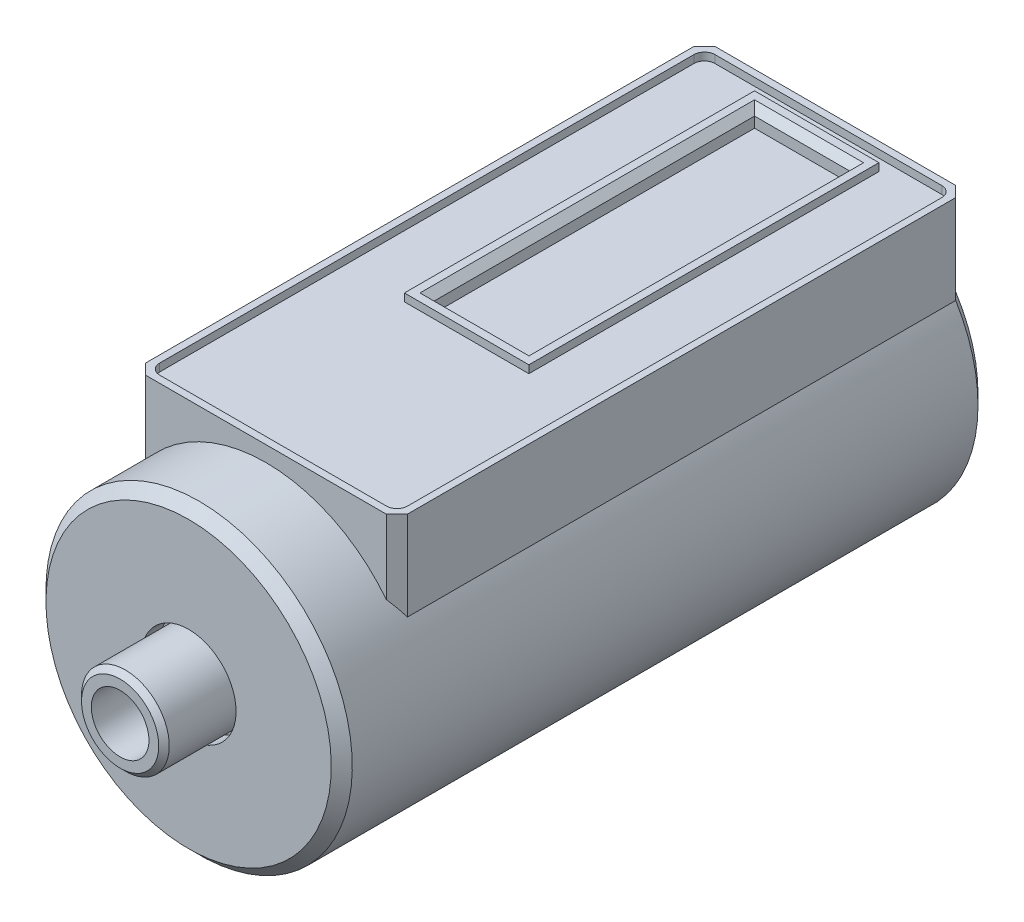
from build123d import *

# Parameters (mm, degrees)
EXTRUDE1_DEPTH     = 12.19
CHAMFER1_SIZE      = 0.76
SKETCH4_W          = 8.99
SKETCH4_H          = 25.3
CUT_EXTRUDE1_DEPTH = 0.56
SKETCH5_W          = 6.86
SKETCH5_H          = 23.16
CUT_EXTRUDE2_DEPTH = 1.27
CHAMFER2_SIZE      = 0.51
HOLE1_D            = 4.1656
HOLE1_DEPTH        = 6.35
HOLE1_TIP          = 1.251472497


with BuildPart() as part:
    # Sketch2 → Revolve1 (revolve)
    with BuildSketch(Plane(origin=(0, 0, 0), x_dir=(0, 0, -1), z_dir=(1, 0, 0))):
        Polygon((46.735, 0), (46.735, 2.79), (47.115, 3.17), (52.955, 3.17), (52.955, 3.43), (51.685, 3.43), (51.685, 10.31), (52.445, 11.07), (98.425, 11.07), (98.425, 0), align=None)
    revolve(axis=Axis((0, 0, -98.425), (0, 0, 1)))

    # Sketch3 → Extrude1 (add)
    with BuildSketch(Plane(origin=(0, 0, 0), x_dir=(1, 0, 0), z_dir=(0, 1, 0))):
        Polygon((-9.46, 98.425), (9.46, 98.425), (9.46, 58.035), (8.7, 57.275), (-8.7, 57.275), (-9.46, 58.035), align=None)
    extrude(amount=EXTRUDE1_DEPTH)

    # Chamfer1
    chamfer1_edges = [part.edges().sort_by_distance(p)[0] for p in [
        (-9.46, 8.969599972, -98.425),
        (9.46, 8.969599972, -98.425),
        (0, -11.07, -98.425),
    ]]
    chamfer(chamfer1_edges, length=CHAMFER1_SIZE)

    # Sketch4 → Cut-Extrude1 (cut)
    with BuildSketch(Plane(origin=(0, 12.19, 0), x_dir=(1, 0, 0), z_dir=(0, 1, 0))):
        with BuildLine():
            Line((-8.19, 97.915), (8.2, 97.915))
            ThreePointArc((8.2, 97.915), (8.737401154, 97.692401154), (8.96, 97.155))
            Line((8.96, 97.155), (8.96, 58.545))
            ThreePointArc((8.96, 58.545), (8.737401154, 58.007598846), (8.2, 57.785))
            Line((8.2, 57.785), (-8.19, 57.785))
            ThreePointArc((-8.19, 57.785), (-8.727401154, 58.007598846), (-8.95, 58.545))
            Line((-8.95, 58.545), (-8.95, 97.155))
            ThreePointArc((-8.95, 97.155), (-8.727401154, 97.692401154), (-8.19, 97.915))
        make_face()
        with Locations((0.005, 84.425)):
            Rectangle(SKETCH4_W, SKETCH4_H, mode=Mode.SUBTRACT)
    extrude(amount=-CUT_EXTRUDE1_DEPTH, mode=Mode.SUBTRACT)

    # Sketch5 → Cut-Extrude2 (cut)
    with BuildSketch(Plane(origin=(0, 12.19, 0), x_dir=(1, 0, 0), z_dir=(0, 1, 0))):
        with Locations((0.01, 84.425)):
            Rectangle(SKETCH5_W, SKETCH5_H)
    extrude(amount=-CUT_EXTRUDE2_DEPTH, mode=Mode.SUBTRACT)

    # Chamfer2
    chamfer2_edges = [part.edges().sort_by_distance(p)[0] for p in [
        (-3.42, 12.19, -84.425),
        (0.01, 12.19, -72.845),
        (3.44, 12.19, -84.425),
        (0.01, 12.19, -96.005),
    ]]
    chamfer(chamfer2_edges, length=CHAMFER2_SIZE)

    # Hole1
    with Locations(Plane.XY.offset(-46.735)):
        with Locations((0, 0)):
            Hole(HOLE1_D / 2, depth=HOLE1_DEPTH)
            with Locations((0, 0, -(HOLE1_DEPTH + HOLE1_TIP / 2))):  # 118° drill point
                Cone(0, HOLE1_D / 2, HOLE1_TIP, mode=Mode.SUBTRACT)


solid = part.part
